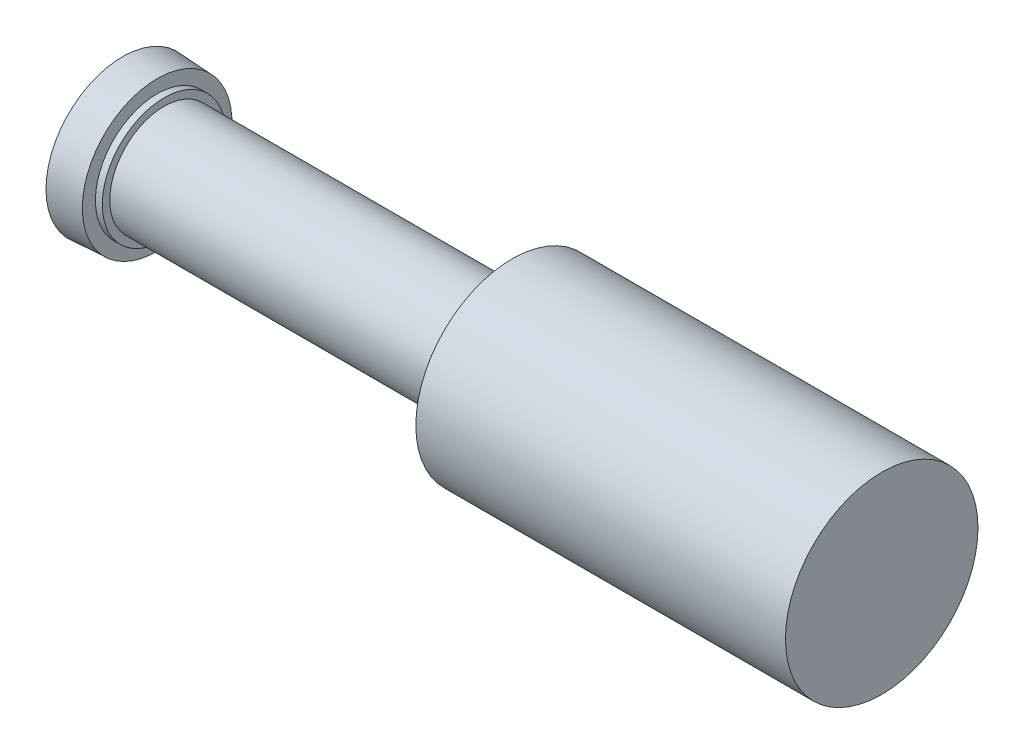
ISO-10303-21;
HEADER;
FILE_DESCRIPTION(('STEP AP214'),'2;1');
FILE_NAME('part.step','',(''),(''),'','','');
FILE_SCHEMA(('AUTOMOTIVE_DESIGN { 1 0 10303 214 1 1 1 1 }'));
ENDSEC;
DATA;
#1=APPLICATION_CONTEXT('core data for automotive mechanical design processes');
#2=APPLICATION_PROTOCOL_DEFINITION('international standard','automotive_design',2000,#1);
#3=PRODUCT_CONTEXT('',#1,'mechanical');
#4=PRODUCT('Part','Part','',(#3));
#5=PRODUCT_RELATED_PRODUCT_CATEGORY('part','',(#4));
#6=PRODUCT_DEFINITION_FORMATION('','',#4);
#7=PRODUCT_DEFINITION_CONTEXT('part definition',#1,'design');
#8=PRODUCT_DEFINITION('design','',#6,#7);
#9=PRODUCT_DEFINITION_SHAPE('','',#8);
#10=(LENGTH_UNIT() NAMED_UNIT(*) SI_UNIT(.MILLI.,.METRE.));
#11=(NAMED_UNIT(*) PLANE_ANGLE_UNIT() SI_UNIT($,.RADIAN.));
#12=(NAMED_UNIT(*) SI_UNIT($,.STERADIAN.) SOLID_ANGLE_UNIT());
#13=UNCERTAINTY_MEASURE_WITH_UNIT(LENGTH_MEASURE(1.E-05),#10,'distance_accuracy_value','');
#14=(GEOMETRIC_REPRESENTATION_CONTEXT(3) GLOBAL_UNCERTAINTY_ASSIGNED_CONTEXT((#13)) GLOBAL_UNIT_ASSIGNED_CONTEXT((#10,
#11,#12)) REPRESENTATION_CONTEXT('',''));
#15=CARTESIAN_POINT('',(0.,0.,0.));
#16=DIRECTION('',(0.,0.,1.));
#17=DIRECTION('',(1.,0.,0.));
#18=AXIS2_PLACEMENT_3D('',#15,#16,#17);
#19=CARTESIAN_POINT('',(-25.,0.,0.));
#20=DIRECTION('',(-1.,0.,0.));
#21=DIRECTION('',(0.,0.,1.));
#22=AXIS2_PLACEMENT_3D('',#19,#20,#21);
#23=PLANE('',#22);
#24=CARTESIAN_POINT('',(-25.,0.,0.));
#25=DIRECTION('',(-1.,0.,0.));
#26=DIRECTION('',(0.,0.,1.));
#27=AXIS2_PLACEMENT_3D('',#24,#25,#26);
#28=CIRCLE('',#27,5.4189805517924);
#29=CARTESIAN_POINT('',(-25.,0.,5.4189805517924));
#30=VERTEX_POINT('',#29);
#31=EDGE_CURVE('E52',#30,#30,#28,.F.);
#32=ORIENTED_EDGE('',*,*,#31,.T.);
#33=EDGE_LOOP('',(#32));
#34=FACE_BOUND('',#33,.T.);
#35=CARTESIAN_POINT('',(-25.,0.,0.));
#36=DIRECTION('',(-1.,0.,0.));
#37=DIRECTION('',(0.,0.,1.));
#38=AXIS2_PLACEMENT_3D('',#35,#36,#37);
#39=CIRCLE('',#38,4.47);
#40=CARTESIAN_POINT('',(-25.,0.,4.47));
#41=VERTEX_POINT('',#40);
#42=EDGE_CURVE('E57',#41,#41,#39,.T.);
#43=ORIENTED_EDGE('',*,*,#42,.T.);
#44=EDGE_LOOP('',(#43));
#45=FACE_BOUND('',#44,.T.);
#46=ADVANCED_FACE('F39',(#34,#45),#23,.F.);
#47=CARTESIAN_POINT('',(-24.5,0.,0.));
#48=DIRECTION('',(-1.,0.,0.));
#49=DIRECTION('',(0.,0.,1.));
#50=AXIS2_PLACEMENT_3D('',#47,#48,#49);
#51=CYLINDRICAL_SURFACE('',#50,4.47);
#52=CARTESIAN_POINT('',(-24.5,0.,0.));
#53=DIRECTION('',(-1.,0.,0.));
#54=DIRECTION('',(0.,0.,1.));
#55=AXIS2_PLACEMENT_3D('',#52,#53,#54);
#56=CIRCLE('',#55,4.47);
#57=CARTESIAN_POINT('',(-24.5,0.,4.47));
#58=VERTEX_POINT('',#57);
#59=EDGE_CURVE('E63',#58,#58,#56,.F.);
#60=ORIENTED_EDGE('',*,*,#59,.F.);
#61=EDGE_LOOP('',(#60));
#62=FACE_BOUND('',#61,.T.);
#63=ORIENTED_EDGE('',*,*,#42,.F.);
#64=EDGE_LOOP('',(#63));
#65=FACE_BOUND('',#64,.T.);
#66=ADVANCED_FACE('F99',(#62,#65),#51,.T.);
#67=CARTESIAN_POINT('',(-27.5,0.,0.));
#68=DIRECTION('',(1.,0.,0.));
#69=DIRECTION('',(0.,0.,-1.));
#70=AXIS2_PLACEMENT_3D('',#67,#68,#69);
#71=PLANE('',#70);
#72=CARTESIAN_POINT('',(-27.5,0.,0.));
#73=DIRECTION('',(-1.,0.,0.));
#74=DIRECTION('',(0.,0.,1.));
#75=AXIS2_PLACEMENT_3D('',#72,#73,#74);
#76=CIRCLE('',#75,5.55);
#77=CARTESIAN_POINT('',(-27.5,0.,5.55));
#78=VERTEX_POINT('',#77);
#79=EDGE_CURVE('E47',#78,#78,#76,.T.);
#80=ORIENTED_EDGE('',*,*,#79,.T.);
#81=EDGE_LOOP('',(#80));
#82=FACE_BOUND('',#81,.T.);
#83=ADVANCED_FACE('F105',(#82),#71,.F.);
#84=CARTESIAN_POINT('',(-27.5,0.,0.));
#85=DIRECTION('',(-1.,0.,0.));
#86=DIRECTION('',(0.,0.,1.));
#87=AXIS2_PLACEMENT_3D('',#84,#85,#86);
#88=CONICAL_SURFACE('',#87,5.55,0.05235987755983);
#89=ORIENTED_EDGE('',*,*,#31,.F.);
#90=EDGE_LOOP('',(#89));
#91=FACE_BOUND('',#90,.T.);
#92=ORIENTED_EDGE('',*,*,#79,.F.);
#93=EDGE_LOOP('',(#92));
#94=FACE_BOUND('',#93,.T.);
#95=ADVANCED_FACE('F87',(#91,#94),#88,.T.);
#96=CARTESIAN_POINT('',(0.719999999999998,0.,0.));
#97=DIRECTION('',(-1.,0.,0.));
#98=DIRECTION('',(0.,0.,1.));
#99=AXIS2_PLACEMENT_3D('',#96,#97,#98);
#100=PLANE('',#99);
#101=CARTESIAN_POINT('',(0.719999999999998,0.,0.));
#102=DIRECTION('',(-1.,0.,0.));
#103=DIRECTION('',(0.,0.,1.));
#104=AXIS2_PLACEMENT_3D('',#101,#102,#103);
#105=CIRCLE('',#104,3.93);
#106=CARTESIAN_POINT('',(0.719999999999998,0.,3.93));
#107=VERTEX_POINT('',#106);
#108=EDGE_CURVE('E71',#107,#107,#105,.T.);
#109=ORIENTED_EDGE('',*,*,#108,.F.);
#110=EDGE_LOOP('',(#109));
#111=FACE_BOUND('',#110,.T.);
#112=CARTESIAN_POINT('',(0.719999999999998,0.,0.));
#113=DIRECTION('',(-1.,0.,0.));
#114=DIRECTION('',(0.,0.,1.));
#115=AXIS2_PLACEMENT_3D('',#112,#113,#114);
#116=CIRCLE('',#115,6.975);
#117=CARTESIAN_POINT('',(0.719999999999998,0.,6.975));
#118=VERTEX_POINT('',#117);
#119=EDGE_CURVE('E67',#118,#118,#116,.T.);
#120=ORIENTED_EDGE('',*,*,#119,.T.);
#121=EDGE_LOOP('',(#120));
#122=FACE_BOUND('',#121,.T.);
#123=ADVANCED_FACE('F83',(#111,#122),#100,.T.);
#124=CARTESIAN_POINT('',(-24.5,0.,0.));
#125=DIRECTION('',(-1.,0.,0.));
#126=DIRECTION('',(0.,0.,1.));
#127=AXIS2_PLACEMENT_3D('',#124,#125,#126);
#128=PLANE('',#127);
#129=ORIENTED_EDGE('',*,*,#59,.T.);
#130=EDGE_LOOP('',(#129));
#131=FACE_BOUND('',#130,.T.);
#132=CARTESIAN_POINT('',(-24.5,0.,0.));
#133=DIRECTION('',(-1.,0.,0.));
#134=DIRECTION('',(0.,0.,1.));
#135=AXIS2_PLACEMENT_3D('',#132,#133,#134);
#136=CIRCLE('',#135,3.93);
#137=CARTESIAN_POINT('',(-24.5,0.,3.93));
#138=VERTEX_POINT('',#137);
#139=EDGE_CURVE('E72',#138,#138,#136,.T.);
#140=ORIENTED_EDGE('',*,*,#139,.T.);
#141=EDGE_LOOP('',(#140));
#142=FACE_BOUND('',#141,.T.);
#143=ADVANCED_FACE('F86',(#131,#142),#128,.F.);
#144=CARTESIAN_POINT('',(0.719999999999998,0.,0.));
#145=DIRECTION('',(-1.,0.,0.));
#146=DIRECTION('',(0.,0.,1.));
#147=AXIS2_PLACEMENT_3D('',#144,#145,#146);
#148=CYLINDRICAL_SURFACE('',#147,3.93);
#149=ORIENTED_EDGE('',*,*,#108,.T.);
#150=EDGE_LOOP('',(#149));
#151=FACE_BOUND('',#150,.T.);
#152=ORIENTED_EDGE('',*,*,#139,.F.);
#153=EDGE_LOOP('',(#152));
#154=FACE_BOUND('',#153,.T.);
#155=ADVANCED_FACE('F80',(#151,#154),#148,.T.);
#156=CARTESIAN_POINT('',(27.5,0.,0.));
#157=DIRECTION('',(1.,0.,0.));
#158=DIRECTION('',(0.,0.,-1.));
#159=AXIS2_PLACEMENT_3D('',#156,#157,#158);
#160=PLANE('',#159);
#161=CARTESIAN_POINT('',(27.5,0.,0.));
#162=DIRECTION('',(1.,0.,0.));
#163=DIRECTION('',(0.,0.,-1.));
#164=AXIS2_PLACEMENT_3D('',#161,#162,#163);
#165=CIRCLE('',#164,6.975);
#166=CARTESIAN_POINT('',(27.5,0.,-6.975));
#167=VERTEX_POINT('',#166);
#168=EDGE_CURVE('E10',#167,#167,#165,.T.);
#169=ORIENTED_EDGE('',*,*,#168,.T.);
#170=EDGE_LOOP('',(#169));
#171=FACE_BOUND('',#170,.T.);
#172=ADVANCED_FACE('F92',(#171),#160,.T.);
#173=CARTESIAN_POINT('',(27.5,0.,0.));
#174=DIRECTION('',(-1.,0.,0.));
#175=DIRECTION('',(0.,0.,1.));
#176=AXIS2_PLACEMENT_3D('',#173,#174,#175);
#177=CYLINDRICAL_SURFACE('',#176,6.975);
#178=ORIENTED_EDGE('',*,*,#168,.F.);
#179=EDGE_LOOP('',(#178));
#180=FACE_BOUND('',#179,.T.);
#181=ORIENTED_EDGE('',*,*,#119,.F.);
#182=EDGE_LOOP('',(#181));
#183=FACE_BOUND('',#182,.T.);
#184=ADVANCED_FACE('F41',(#180,#183),#177,.T.);
#185=CLOSED_SHELL('',(#46,#66,#83,#95,#123,#143,#155,#172,#184));
#186=MANIFOLD_SOLID_BREP('B2',#185);
#187=ADVANCED_BREP_SHAPE_REPRESENTATION('',(#18,#186),#14);
#188=SHAPE_DEFINITION_REPRESENTATION(#9,#187);
ENDSEC;
END-ISO-10303-21;
